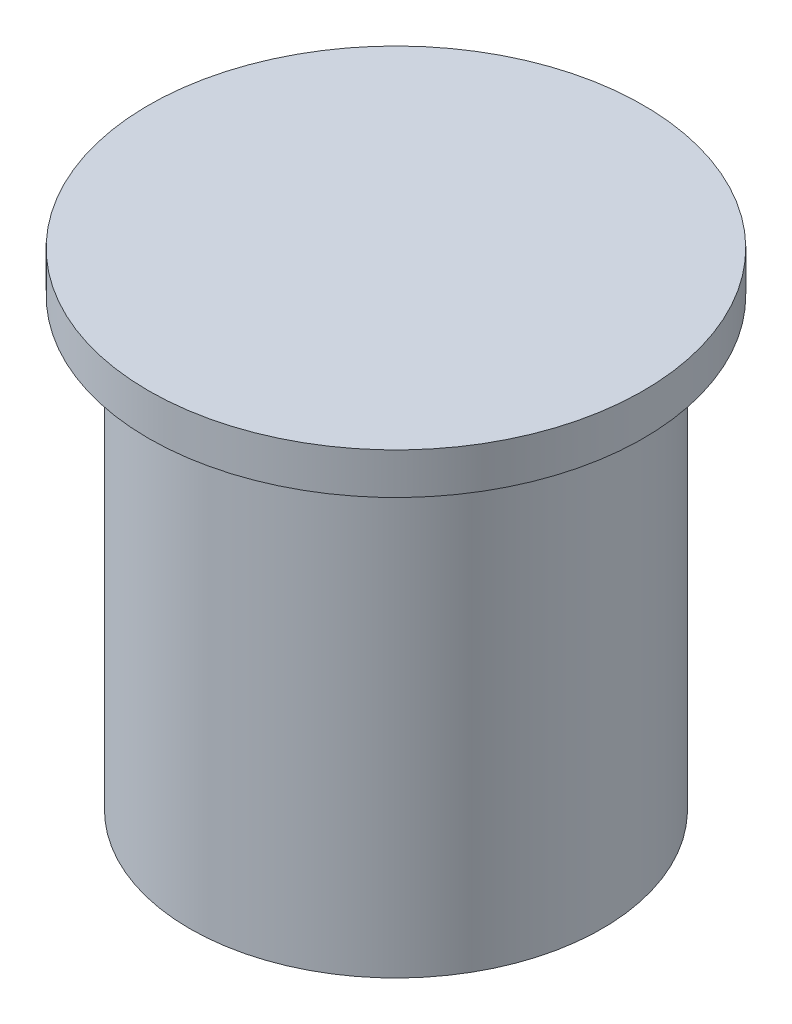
ISO-10303-21;
HEADER;
FILE_DESCRIPTION(('STEP AP214'),'2;1');
FILE_NAME('part.step','',(''),(''),'','','');
FILE_SCHEMA(('AUTOMOTIVE_DESIGN { 1 0 10303 214 1 1 1 1 }'));
ENDSEC;
DATA;
#1=APPLICATION_CONTEXT('core data for automotive mechanical design processes');
#2=APPLICATION_PROTOCOL_DEFINITION('international standard','automotive_design',2000,#1);
#3=PRODUCT_CONTEXT('',#1,'mechanical');
#4=PRODUCT('Part','Part','',(#3));
#5=PRODUCT_RELATED_PRODUCT_CATEGORY('part','',(#4));
#6=PRODUCT_DEFINITION_FORMATION('','',#4);
#7=PRODUCT_DEFINITION_CONTEXT('part definition',#1,'design');
#8=PRODUCT_DEFINITION('design','',#6,#7);
#9=PRODUCT_DEFINITION_SHAPE('','',#8);
#10=(LENGTH_UNIT() NAMED_UNIT(*) SI_UNIT(.MILLI.,.METRE.));
#11=(NAMED_UNIT(*) PLANE_ANGLE_UNIT() SI_UNIT($,.RADIAN.));
#12=(NAMED_UNIT(*) SI_UNIT($,.STERADIAN.) SOLID_ANGLE_UNIT());
#13=UNCERTAINTY_MEASURE_WITH_UNIT(LENGTH_MEASURE(1.E-05),#10,'distance_accuracy_value','');
#14=(GEOMETRIC_REPRESENTATION_CONTEXT(3) GLOBAL_UNCERTAINTY_ASSIGNED_CONTEXT((#13)) GLOBAL_UNIT_ASSIGNED_CONTEXT((#10,
#11,#12)) REPRESENTATION_CONTEXT('',''));
#15=CARTESIAN_POINT('',(0.,0.,0.));
#16=DIRECTION('',(0.,0.,1.));
#17=DIRECTION('',(1.,0.,0.));
#18=AXIS2_PLACEMENT_3D('',#15,#16,#17);
#19=CARTESIAN_POINT('',(0.,34.29,0.));
#20=DIRECTION('',(0.,-1.,0.));
#21=DIRECTION('',(0.,0.,-1.));
#22=AXIS2_PLACEMENT_3D('',#19,#20,#21);
#23=CYLINDRICAL_SURFACE('',#22,15.875);
#24=CARTESIAN_POINT('',(0.,34.29,0.));
#25=DIRECTION('',(0.,1.,0.));
#26=DIRECTION('',(0.,0.,1.));
#27=AXIS2_PLACEMENT_3D('',#24,#25,#26);
#28=CIRCLE('',#27,15.875);
#29=CARTESIAN_POINT('',(0.,34.29,15.875));
#30=VERTEX_POINT('',#29);
#31=EDGE_CURVE('E10',#30,#30,#28,.T.);
#32=ORIENTED_EDGE('',*,*,#31,.F.);
#33=EDGE_LOOP('',(#32));
#34=FACE_BOUND('',#33,.T.);
#35=CARTESIAN_POINT('',(0.,0.,0.));
#36=DIRECTION('',(0.,1.,0.));
#37=DIRECTION('',(0.,0.,1.));
#38=AXIS2_PLACEMENT_3D('',#35,#36,#37);
#39=CIRCLE('',#38,15.875);
#40=CARTESIAN_POINT('',(0.,0.,15.875));
#41=VERTEX_POINT('',#40);
#42=EDGE_CURVE('E33',#41,#41,#39,.T.);
#43=ORIENTED_EDGE('',*,*,#42,.T.);
#44=EDGE_LOOP('',(#43));
#45=FACE_BOUND('',#44,.T.);
#46=ADVANCED_FACE('F30',(#34,#45),#23,.T.);
#47=CARTESIAN_POINT('',(0.,0.,0.));
#48=DIRECTION('',(0.,1.,0.));
#49=DIRECTION('',(0.,0.,1.));
#50=AXIS2_PLACEMENT_3D('',#47,#48,#49);
#51=PLANE('',#50);
#52=ORIENTED_EDGE('',*,*,#42,.F.);
#53=EDGE_LOOP('',(#52));
#54=FACE_BOUND('',#53,.T.);
#55=ADVANCED_FACE('F58',(#54),#51,.F.);
#56=CARTESIAN_POINT('',(0.,34.29,0.));
#57=DIRECTION('',(0.,1.,0.));
#58=DIRECTION('',(0.,0.,1.));
#59=AXIS2_PLACEMENT_3D('',#56,#57,#58);
#60=PLANE('',#59);
#61=CARTESIAN_POINT('',(0.,34.29,0.));
#62=DIRECTION('',(0.,1.,0.));
#63=DIRECTION('',(0.,0.,1.));
#64=AXIS2_PLACEMENT_3D('',#61,#62,#63);
#65=CIRCLE('',#64,19.05);
#66=CARTESIAN_POINT('',(0.,34.29,19.05));
#67=VERTEX_POINT('',#66);
#68=EDGE_CURVE('E42',#67,#67,#65,.T.);
#69=ORIENTED_EDGE('',*,*,#68,.F.);
#70=EDGE_LOOP('',(#69));
#71=FACE_BOUND('',#70,.T.);
#72=ORIENTED_EDGE('',*,*,#31,.T.);
#73=EDGE_LOOP('',(#72));
#74=FACE_BOUND('',#73,.T.);
#75=ADVANCED_FACE('F53',(#71,#74),#60,.F.);
#76=CARTESIAN_POINT('',(0.,37.465,0.));
#77=DIRECTION('',(0.,-1.,0.));
#78=DIRECTION('',(0.,0.,-1.));
#79=AXIS2_PLACEMENT_3D('',#76,#77,#78);
#80=CYLINDRICAL_SURFACE('',#79,19.05);
#81=CARTESIAN_POINT('',(0.,37.465,0.));
#82=DIRECTION('',(0.,1.,0.));
#83=DIRECTION('',(0.,0.,1.));
#84=AXIS2_PLACEMENT_3D('',#81,#82,#83);
#85=CIRCLE('',#84,19.05);
#86=CARTESIAN_POINT('',(0.,37.465,19.05));
#87=VERTEX_POINT('',#86);
#88=EDGE_CURVE('E40',#87,#87,#85,.T.);
#89=ORIENTED_EDGE('',*,*,#88,.F.);
#90=EDGE_LOOP('',(#89));
#91=FACE_BOUND('',#90,.T.);
#92=ORIENTED_EDGE('',*,*,#68,.T.);
#93=EDGE_LOOP('',(#92));
#94=FACE_BOUND('',#93,.T.);
#95=ADVANCED_FACE('F50',(#91,#94),#80,.T.);
#96=CARTESIAN_POINT('',(0.,37.465,0.));
#97=DIRECTION('',(0.,1.,0.));
#98=DIRECTION('',(0.,0.,1.));
#99=AXIS2_PLACEMENT_3D('',#96,#97,#98);
#100=PLANE('',#99);
#101=ORIENTED_EDGE('',*,*,#88,.T.);
#102=EDGE_LOOP('',(#101));
#103=FACE_BOUND('',#102,.T.);
#104=ADVANCED_FACE('F48',(#103),#100,.T.);
#105=CLOSED_SHELL('',(#46,#55,#75,#95,#104));
#106=MANIFOLD_SOLID_BREP('B2',#105);
#107=ADVANCED_BREP_SHAPE_REPRESENTATION('',(#18,#106),#14);
#108=SHAPE_DEFINITION_REPRESENTATION(#9,#107);
ENDSEC;
END-ISO-10303-21;
